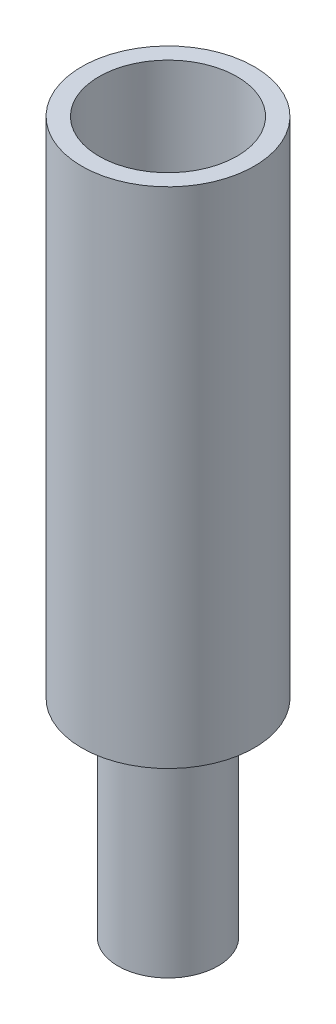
ISO-10303-21;
HEADER;
FILE_DESCRIPTION(('STEP AP214'),'2;1');
FILE_NAME('part.step','',(''),(''),'','','');
FILE_SCHEMA(('AUTOMOTIVE_DESIGN { 1 0 10303 214 1 1 1 1 }'));
ENDSEC;
DATA;
#1=APPLICATION_CONTEXT('core data for automotive mechanical design processes');
#2=APPLICATION_PROTOCOL_DEFINITION('international standard','automotive_design',2000,#1);
#3=PRODUCT_CONTEXT('',#1,'mechanical');
#4=PRODUCT('Part','Part','',(#3));
#5=PRODUCT_RELATED_PRODUCT_CATEGORY('part','',(#4));
#6=PRODUCT_DEFINITION_FORMATION('','',#4);
#7=PRODUCT_DEFINITION_CONTEXT('part definition',#1,'design');
#8=PRODUCT_DEFINITION('design','',#6,#7);
#9=PRODUCT_DEFINITION_SHAPE('','',#8);
#10=(LENGTH_UNIT() NAMED_UNIT(*) SI_UNIT(.MILLI.,.METRE.));
#11=(NAMED_UNIT(*) PLANE_ANGLE_UNIT() SI_UNIT($,.RADIAN.));
#12=(NAMED_UNIT(*) SI_UNIT($,.STERADIAN.) SOLID_ANGLE_UNIT());
#13=UNCERTAINTY_MEASURE_WITH_UNIT(LENGTH_MEASURE(1.E-05),#10,'distance_accuracy_value','');
#14=(GEOMETRIC_REPRESENTATION_CONTEXT(3) GLOBAL_UNCERTAINTY_ASSIGNED_CONTEXT((#13)) GLOBAL_UNIT_ASSIGNED_CONTEXT((#10,
#11,#12)) REPRESENTATION_CONTEXT('',''));
#15=CARTESIAN_POINT('',(0.,0.,0.));
#16=DIRECTION('',(0.,0.,1.));
#17=DIRECTION('',(1.,0.,0.));
#18=AXIS2_PLACEMENT_3D('',#15,#16,#17);
#19=CARTESIAN_POINT('',(0.,30.,0.));
#20=DIRECTION('',(0.,-1.,0.));
#21=DIRECTION('',(0.,0.,-1.));
#22=AXIS2_PLACEMENT_3D('',#19,#20,#21);
#23=CYLINDRICAL_SURFACE('',#22,7.25);
#24=CARTESIAN_POINT('',(0.,30.,0.));
#25=DIRECTION('',(0.,1.,0.));
#26=DIRECTION('',(0.,0.,1.));
#27=AXIS2_PLACEMENT_3D('',#24,#25,#26);
#28=CIRCLE('',#27,7.25);
#29=CARTESIAN_POINT('',(0.,30.,7.25));
#30=VERTEX_POINT('',#29);
#31=EDGE_CURVE('E43',#30,#30,#28,.T.);
#32=ORIENTED_EDGE('',*,*,#31,.F.);
#33=EDGE_LOOP('',(#32));
#34=FACE_BOUND('',#33,.T.);
#35=CARTESIAN_POINT('',(0.,0.,0.));
#36=DIRECTION('',(0.,1.,0.));
#37=DIRECTION('',(0.,0.,1.));
#38=AXIS2_PLACEMENT_3D('',#35,#36,#37);
#39=CIRCLE('',#38,7.25);
#40=CARTESIAN_POINT('',(0.,0.,7.25));
#41=VERTEX_POINT('',#40);
#42=EDGE_CURVE('E47',#41,#41,#39,.T.);
#43=ORIENTED_EDGE('',*,*,#42,.T.);
#44=EDGE_LOOP('',(#43));
#45=FACE_BOUND('',#44,.T.);
#46=ADVANCED_FACE('F37',(#34,#45),#23,.T.);
#47=CARTESIAN_POINT('',(0.,0.,0.));
#48=DIRECTION('',(0.,1.,0.));
#49=DIRECTION('',(0.,0.,1.));
#50=AXIS2_PLACEMENT_3D('',#47,#48,#49);
#51=PLANE('',#50);
#52=ORIENTED_EDGE('',*,*,#42,.F.);
#53=EDGE_LOOP('',(#52));
#54=FACE_BOUND('',#53,.T.);
#55=ADVANCED_FACE('F81',(#54),#51,.F.);
#56=CARTESIAN_POINT('',(0.,30.,0.));
#57=DIRECTION('',(0.,1.,0.));
#58=DIRECTION('',(0.,0.,1.));
#59=AXIS2_PLACEMENT_3D('',#56,#57,#58);
#60=PLANE('',#59);
#61=CARTESIAN_POINT('',(0.,30.,0.));
#62=DIRECTION('',(0.,1.,0.));
#63=DIRECTION('',(0.,0.,1.));
#64=AXIS2_PLACEMENT_3D('',#61,#62,#63);
#65=CIRCLE('',#64,12.5);
#66=CARTESIAN_POINT('',(0.,30.,12.5));
#67=VERTEX_POINT('',#66);
#68=EDGE_CURVE('E52',#67,#67,#65,.T.);
#69=ORIENTED_EDGE('',*,*,#68,.F.);
#70=EDGE_LOOP('',(#69));
#71=FACE_BOUND('',#70,.T.);
#72=ORIENTED_EDGE('',*,*,#31,.T.);
#73=EDGE_LOOP('',(#72));
#74=FACE_BOUND('',#73,.T.);
#75=ADVANCED_FACE('F76',(#71,#74),#60,.F.);
#76=CARTESIAN_POINT('',(0.,33.,0.));
#77=DIRECTION('',(0.,-1.,0.));
#78=DIRECTION('',(0.,0.,-1.));
#79=AXIS2_PLACEMENT_3D('',#76,#77,#78);
#80=CYLINDRICAL_SURFACE('',#79,12.5);
#81=ORIENTED_EDGE('',*,*,#68,.T.);
#82=EDGE_LOOP('',(#81));
#83=FACE_BOUND('',#82,.T.);
#84=CARTESIAN_POINT('',(0.,103.,0.));
#85=DIRECTION('',(0.,1.,0.));
#86=DIRECTION('',(0.,0.,1.));
#87=AXIS2_PLACEMENT_3D('',#84,#85,#86);
#88=CIRCLE('',#87,12.5);
#89=CARTESIAN_POINT('',(0.,103.,12.5));
#90=VERTEX_POINT('',#89);
#91=EDGE_CURVE('E56',#90,#90,#88,.T.);
#92=ORIENTED_EDGE('',*,*,#91,.F.);
#93=EDGE_LOOP('',(#92));
#94=FACE_BOUND('',#93,.T.);
#95=ADVANCED_FACE('F67',(#83,#94),#80,.T.);
#96=CARTESIAN_POINT('',(0.,103.,0.));
#97=DIRECTION('',(0.,1.,0.));
#98=DIRECTION('',(0.,0.,1.));
#99=AXIS2_PLACEMENT_3D('',#96,#97,#98);
#100=PLANE('',#99);
#101=ORIENTED_EDGE('',*,*,#91,.T.);
#102=EDGE_LOOP('',(#101));
#103=FACE_BOUND('',#102,.T.);
#104=CARTESIAN_POINT('',(0.,103.,0.));
#105=DIRECTION('',(0.,1.,0.));
#106=DIRECTION('',(1.,0.,0.));
#107=AXIS2_PLACEMENT_3D('',#104,#105,#106);
#108=CIRCLE('',#107,10.);
#109=CARTESIAN_POINT('',(10.,103.,0.));
#110=VERTEX_POINT('',#109);
#111=EDGE_CURVE('E59',#110,#110,#108,.T.);
#112=ORIENTED_EDGE('',*,*,#111,.F.);
#113=EDGE_LOOP('',(#112));
#114=FACE_BOUND('',#113,.T.);
#115=ADVANCED_FACE('F65',(#103,#114),#100,.T.);
#116=CARTESIAN_POINT('',(0.,103.,0.));
#117=DIRECTION('',(0.,-1.,0.));
#118=DIRECTION('',(0.,0.,-1.));
#119=AXIS2_PLACEMENT_3D('',#116,#117,#118);
#120=CYLINDRICAL_SURFACE('',#119,10.);
#121=ORIENTED_EDGE('',*,*,#111,.T.);
#122=EDGE_LOOP('',(#121));
#123=FACE_BOUND('',#122,.T.);
#124=CARTESIAN_POINT('',(0.,33.,0.));
#125=DIRECTION('',(0.,1.,0.));
#126=DIRECTION('',(0.,0.,1.));
#127=AXIS2_PLACEMENT_3D('',#124,#125,#126);
#128=CIRCLE('',#127,10.);
#129=CARTESIAN_POINT('',(0.,33.,10.));
#130=VERTEX_POINT('',#129);
#131=EDGE_CURVE('E11',#130,#130,#128,.F.);
#132=ORIENTED_EDGE('',*,*,#131,.T.);
#133=EDGE_LOOP('',(#132));
#134=FACE_BOUND('',#133,.T.);
#135=ADVANCED_FACE('F63',(#123,#134),#120,.F.);
#136=CARTESIAN_POINT('',(0.,33.,0.));
#137=DIRECTION('',(0.,1.,0.));
#138=DIRECTION('',(0.,0.,1.));
#139=AXIS2_PLACEMENT_3D('',#136,#137,#138);
#140=PLANE('',#139);
#141=ORIENTED_EDGE('',*,*,#131,.F.);
#142=EDGE_LOOP('',(#141));
#143=FACE_BOUND('',#142,.T.);
#144=ADVANCED_FACE('F74',(#143),#140,.T.);
#145=CLOSED_SHELL('',(#46,#55,#75,#95,#115,#135,#144));
#146=MANIFOLD_SOLID_BREP('B2',#145);
#147=ADVANCED_BREP_SHAPE_REPRESENTATION('',(#18,#146),#14);
#148=SHAPE_DEFINITION_REPRESENTATION(#9,#147);
ENDSEC;
END-ISO-10303-21;
